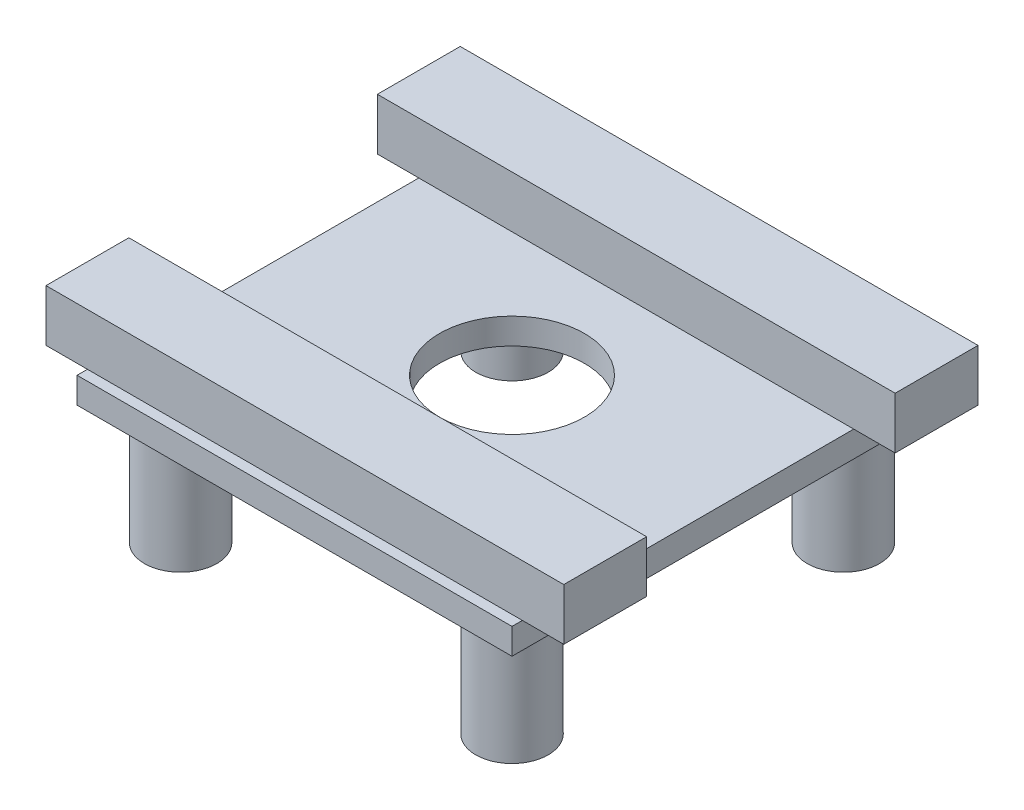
from build123d import *

# Parameters (mm, degrees)
SKETCH1_W           = 100000
SKETCH1_H           = 16000
BOSS_EXTRUDE1_DEPTH = 10000
SKETCH2_W           = 100000
SKETCH2_H           = 16000
BOSS_EXTRUDE2_DEPTH = 10000
SKETCH3_R           = 7000
BOSS_EXTRUDE3_DEPTH = 28000
SKETCH4_W           = 84000
SKETCH4_H           = 84000
SKETCH4_R           = 14000
BOSS_EXTRUDE4_DEPTH = 5000


with BuildPart() as part:
    # Sketch1 → Boss-Extrude1 (new body)
    with BuildSketch(Plane(origin=(0, 0, 0), x_dir=(1, 0, 0), z_dir=(0, 1, 0))):
        with Locations((0, -32000)):
            Rectangle(SKETCH1_W, SKETCH1_H)
    extrude(amount=BOSS_EXTRUDE1_DEPTH)



with BuildPart() as body_2:
    # Sketch2 → Boss-Extrude2 (new body)
    with BuildSketch(Plane(origin=(0, 0, 0), x_dir=(1, 0, 0), z_dir=(0, 1, 0))):
        with Locations((0, 32000)):
            Rectangle(SKETCH2_W, SKETCH2_H)
    extrude(amount=BOSS_EXTRUDE2_DEPTH)


with BuildPart() as part_1:
    add(part.part)

    add(body_2.part)  # Boss-Extrude3 merges body 2
    # Sketch3 → Boss-Extrude3 (add)
    with BuildSketch(Plane(origin=(0, 0, 0), x_dir=(1, 0, 0), z_dir=(0, 1, 0))):
        with Locations(Location((-32000, -32000, 0), (0, 0, 270))):
            Circle(SKETCH3_R)
        with Locations(Location((32000, -32000, 0), (0, 0, 270))):
            Circle(SKETCH3_R)
        with Locations(Location((-32000, 32000, 0), (0, 0, 270))):
            Circle(SKETCH3_R)
        with Locations(Location((32000, 32000, 0), (0, 0, 270))):
            Circle(SKETCH3_R)
    extrude(amount=-BOSS_EXTRUDE3_DEPTH)

    # Sketch4 → Boss-Extrude4 (add)
    with BuildSketch(Plane(origin=(0, 0, 0), x_dir=(1, 0, 0), z_dir=(0, 1, 0))):
        Rectangle(SKETCH4_W, SKETCH4_H)
        with Locations(Location((0, 0, 0), (0, 0, 270))):
            Circle(SKETCH4_R, mode=Mode.SUBTRACT)
    extrude(amount=-BOSS_EXTRUDE4_DEPTH)


solid = part_1.part
